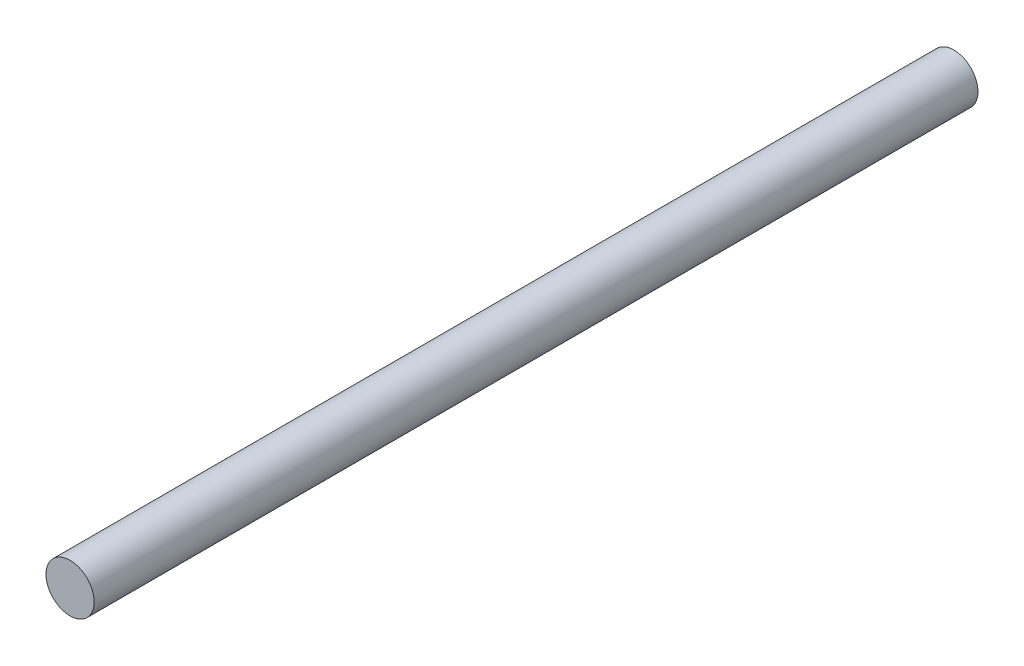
ISO-10303-21;
HEADER;
FILE_DESCRIPTION(('STEP AP214'),'2;1');
FILE_NAME('part.step','',(''),(''),'','','');
FILE_SCHEMA(('AUTOMOTIVE_DESIGN { 1 0 10303 214 1 1 1 1 }'));
ENDSEC;
DATA;
#1=APPLICATION_CONTEXT('core data for automotive mechanical design processes');
#2=APPLICATION_PROTOCOL_DEFINITION('international standard','automotive_design',2000,#1);
#3=PRODUCT_CONTEXT('',#1,'mechanical');
#4=PRODUCT('Part','Part','',(#3));
#5=PRODUCT_RELATED_PRODUCT_CATEGORY('part','',(#4));
#6=PRODUCT_DEFINITION_FORMATION('','',#4);
#7=PRODUCT_DEFINITION_CONTEXT('part definition',#1,'design');
#8=PRODUCT_DEFINITION('design','',#6,#7);
#9=PRODUCT_DEFINITION_SHAPE('','',#8);
#10=(LENGTH_UNIT() NAMED_UNIT(*) SI_UNIT(.MILLI.,.METRE.));
#11=(NAMED_UNIT(*) PLANE_ANGLE_UNIT() SI_UNIT($,.RADIAN.));
#12=(NAMED_UNIT(*) SI_UNIT($,.STERADIAN.) SOLID_ANGLE_UNIT());
#13=UNCERTAINTY_MEASURE_WITH_UNIT(LENGTH_MEASURE(1.E-05),#10,'distance_accuracy_value','');
#14=(GEOMETRIC_REPRESENTATION_CONTEXT(3) GLOBAL_UNCERTAINTY_ASSIGNED_CONTEXT((#13)) GLOBAL_UNIT_ASSIGNED_CONTEXT((#10,
#11,#12)) REPRESENTATION_CONTEXT('',''));
#15=CARTESIAN_POINT('',(0.,0.,0.));
#16=DIRECTION('',(0.,0.,1.));
#17=DIRECTION('',(1.,0.,0.));
#18=AXIS2_PLACEMENT_3D('',#15,#16,#17);
#19=CARTESIAN_POINT('',(0.,0.,13.97));
#20=DIRECTION('',(0.,0.,-1.));
#21=DIRECTION('',(-1.,0.,0.));
#22=AXIS2_PLACEMENT_3D('',#19,#20,#21);
#23=CYLINDRICAL_SURFACE('',#22,0.381);
#24=CARTESIAN_POINT('',(0.,0.,13.97));
#25=DIRECTION('',(0.,0.,1.));
#26=DIRECTION('',(1.,0.,0.));
#27=AXIS2_PLACEMENT_3D('',#24,#25,#26);
#28=CIRCLE('',#27,0.381);
#29=CARTESIAN_POINT('',(0.381,0.,13.97));
#30=VERTEX_POINT('',#29);
#31=EDGE_CURVE('E10',#30,#30,#28,.T.);
#32=ORIENTED_EDGE('',*,*,#31,.F.);
#33=EDGE_LOOP('',(#32));
#34=FACE_BOUND('',#33,.T.);
#35=CARTESIAN_POINT('',(0.,0.,0.));
#36=DIRECTION('',(0.,0.,1.));
#37=DIRECTION('',(1.,0.,0.));
#38=AXIS2_PLACEMENT_3D('',#35,#36,#37);
#39=CIRCLE('',#38,0.381);
#40=CARTESIAN_POINT('',(0.381,0.,0.));
#41=VERTEX_POINT('',#40);
#42=EDGE_CURVE('E32',#41,#41,#39,.T.);
#43=ORIENTED_EDGE('',*,*,#42,.T.);
#44=EDGE_LOOP('',(#43));
#45=FACE_BOUND('',#44,.T.);
#46=ADVANCED_FACE('F29',(#34,#45),#23,.T.);
#47=CARTESIAN_POINT('',(0.,0.,13.97));
#48=DIRECTION('',(0.,0.,1.));
#49=DIRECTION('',(1.,0.,0.));
#50=AXIS2_PLACEMENT_3D('',#47,#48,#49);
#51=PLANE('',#50);
#52=ORIENTED_EDGE('',*,*,#31,.T.);
#53=EDGE_LOOP('',(#52));
#54=FACE_BOUND('',#53,.T.);
#55=ADVANCED_FACE('F44',(#54),#51,.T.);
#56=CARTESIAN_POINT('',(0.,0.,0.));
#57=DIRECTION('',(0.,0.,1.));
#58=DIRECTION('',(1.,0.,0.));
#59=AXIS2_PLACEMENT_3D('',#56,#57,#58);
#60=PLANE('',#59);
#61=ORIENTED_EDGE('',*,*,#42,.F.);
#62=EDGE_LOOP('',(#61));
#63=FACE_BOUND('',#62,.T.);
#64=ADVANCED_FACE('F42',(#63),#60,.F.);
#65=CLOSED_SHELL('',(#46,#55,#64));
#66=MANIFOLD_SOLID_BREP('B2',#65);
#67=ADVANCED_BREP_SHAPE_REPRESENTATION('',(#18,#66),#14);
#68=SHAPE_DEFINITION_REPRESENTATION(#9,#67);
ENDSEC;
END-ISO-10303-21;
